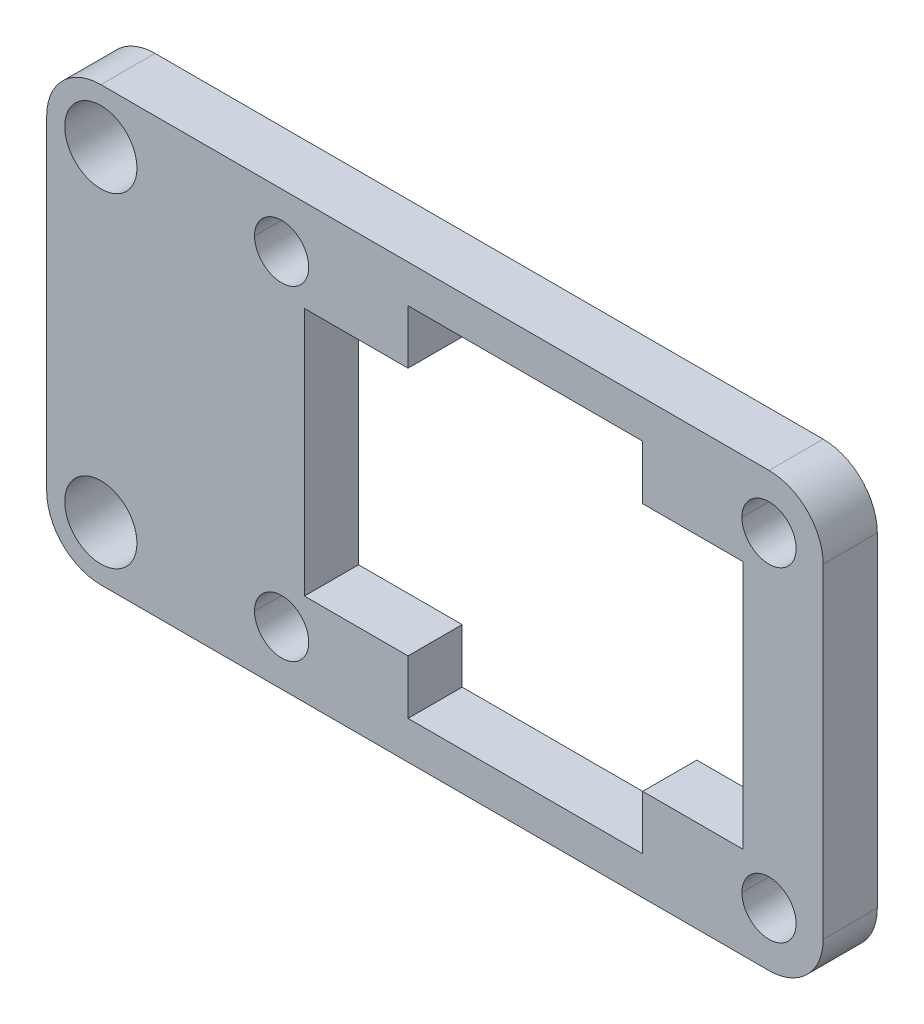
ISO-10303-21;
HEADER;
FILE_DESCRIPTION(('STEP AP214'),'2;1');
FILE_NAME('part.step','',(''),(''),'','','');
FILE_SCHEMA(('AUTOMOTIVE_DESIGN { 1 0 10303 214 1 1 1 1 }'));
ENDSEC;
DATA;
#1=APPLICATION_CONTEXT('core data for automotive mechanical design processes');
#2=APPLICATION_PROTOCOL_DEFINITION('international standard','automotive_design',2000,#1);
#3=PRODUCT_CONTEXT('',#1,'mechanical');
#4=PRODUCT('Part','Part','',(#3));
#5=PRODUCT_RELATED_PRODUCT_CATEGORY('part','',(#4));
#6=PRODUCT_DEFINITION_FORMATION('','',#4);
#7=PRODUCT_DEFINITION_CONTEXT('part definition',#1,'design');
#8=PRODUCT_DEFINITION('design','',#6,#7);
#9=PRODUCT_DEFINITION_SHAPE('','',#8);
#10=(LENGTH_UNIT() NAMED_UNIT(*) SI_UNIT(.MILLI.,.METRE.));
#11=(NAMED_UNIT(*) PLANE_ANGLE_UNIT() SI_UNIT($,.RADIAN.));
#12=(NAMED_UNIT(*) SI_UNIT($,.STERADIAN.) SOLID_ANGLE_UNIT());
#13=UNCERTAINTY_MEASURE_WITH_UNIT(LENGTH_MEASURE(1.E-05),#10,'distance_accuracy_value','');
#14=(GEOMETRIC_REPRESENTATION_CONTEXT(3) GLOBAL_UNCERTAINTY_ASSIGNED_CONTEXT((#13)) GLOBAL_UNIT_ASSIGNED_CONTEXT((#10,
#11,#12)) REPRESENTATION_CONTEXT('',''));
#15=CARTESIAN_POINT('',(0.,0.,0.));
#16=DIRECTION('',(0.,0.,1.));
#17=DIRECTION('',(1.,0.,0.));
#18=AXIS2_PLACEMENT_3D('',#15,#16,#17);
#19=CARTESIAN_POINT('',(63.748376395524,-38.3124718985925,0.));
#20=DIRECTION('',(0.,0.,-1.));
#21=DIRECTION('',(-1.,0.,0.));
#22=AXIS2_PLACEMENT_3D('',#19,#20,#21);
#23=PLANE('',#22);
#24=CARTESIAN_POINT('',(26.7321907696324,-56.3124718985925,0.));
#25=DIRECTION('',(0.,0.,1.));
#26=DIRECTION('',(1.,0.,0.));
#27=AXIS2_PLACEMENT_3D('',#24,#25,#26);
#28=CIRCLE('',#27,2.);
#29=CARTESIAN_POINT('',(28.7321907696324,-56.3124718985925,0.));
#30=VERTEX_POINT('',#29);
#31=EDGE_CURVE('E775',#30,#30,#28,.T.);
#32=ORIENTED_EDGE('',*,*,#31,.T.);
#33=EDGE_LOOP('',(#32));
#34=FACE_BOUND('',#33,.T.);
#35=CARTESIAN_POINT('',(26.7321907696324,-38.3124718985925,0.));
#36=DIRECTION('',(0.,0.,1.));
#37=DIRECTION('',(1.,0.,0.));
#38=AXIS2_PLACEMENT_3D('',#35,#36,#37);
#39=CIRCLE('',#38,2.);
#40=CARTESIAN_POINT('',(28.7321907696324,-38.3124718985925,0.));
#41=VERTEX_POINT('',#40);
#42=EDGE_CURVE('E261',#41,#41,#39,.T.);
#43=ORIENTED_EDGE('',*,*,#42,.T.);
#44=EDGE_LOOP('',(#43));
#45=FACE_BOUND('',#44,.T.);
#46=CARTESIAN_POINT('',(36.748376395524,-38.3124718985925,0.));
#47=DIRECTION('',(0.,0.,-1.));
#48=DIRECTION('',(-1.,0.,0.));
#49=AXIS2_PLACEMENT_3D('',#46,#47,#48);
#50=CIRCLE('',#49,1.5);
#51=CARTESIAN_POINT('',(35.248376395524,-38.3124718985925,0.));
#52=VERTEX_POINT('',#51);
#53=CARTESIAN_POINT('',(38.248376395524,-38.3124718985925,0.));
#54=VERTEX_POINT('',#53);
#55=EDGE_CURVE('E384',#52,#54,#50,.F.);
#56=ORIENTED_EDGE('',*,*,#55,.T.);
#57=CARTESIAN_POINT('',(36.748376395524,-38.3124718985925,0.));
#58=DIRECTION('',(0.,0.,-1.));
#59=DIRECTION('',(-1.,0.,0.));
#60=AXIS2_PLACEMENT_3D('',#57,#58,#59);
#61=CIRCLE('',#60,1.5);
#62=EDGE_CURVE('E33',#54,#52,#61,.F.);
#63=ORIENTED_EDGE('',*,*,#62,.T.);
#64=EDGE_LOOP('',(#56,#63));
#65=FACE_BOUND('',#64,.T.);
#66=CARTESIAN_POINT('',(63.748376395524,-56.3124718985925,0.));
#67=DIRECTION('',(0.,0.,-1.));
#68=DIRECTION('',(-1.,0.,0.));
#69=AXIS2_PLACEMENT_3D('',#66,#67,#68);
#70=CIRCLE('',#69,1.49999999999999);
#71=CARTESIAN_POINT('',(62.248376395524,-56.3124718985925,0.));
#72=VERTEX_POINT('',#71);
#73=CARTESIAN_POINT('',(65.248376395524,-56.3124718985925,0.));
#74=VERTEX_POINT('',#73);
#75=EDGE_CURVE('E376',#72,#74,#70,.F.);
#76=ORIENTED_EDGE('',*,*,#75,.T.);
#77=CARTESIAN_POINT('',(63.748376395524,-56.3124718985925,0.));
#78=DIRECTION('',(0.,0.,-1.));
#79=DIRECTION('',(-1.,0.,0.));
#80=AXIS2_PLACEMENT_3D('',#77,#78,#79);
#81=CIRCLE('',#80,1.49999999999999);
#82=EDGE_CURVE('E380',#74,#72,#81,.F.);
#83=ORIENTED_EDGE('',*,*,#82,.T.);
#84=EDGE_LOOP('',(#76,#83));
#85=FACE_BOUND('',#84,.T.);
#86=CARTESIAN_POINT('',(26.7321907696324,-38.3124718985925,0.));
#87=DIRECTION('',(0.,0.,-1.));
#88=DIRECTION('',(-1.,0.,0.));
#89=AXIS2_PLACEMENT_3D('',#86,#87,#88);
#90=CIRCLE('',#89,3.);
#91=CARTESIAN_POINT('',(26.7321907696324,-35.3124718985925,0.));
#92=VERTEX_POINT('',#91);
#93=CARTESIAN_POINT('',(23.7321907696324,-38.3124718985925,0.));
#94=VERTEX_POINT('',#93);
#95=EDGE_CURVE('E357',#92,#94,#90,.F.);
#96=ORIENTED_EDGE('',*,*,#95,.F.);
#97=DIRECTION('',(1.,0.,0.));
#98=VECTOR('',#97,1.);
#99=CARTESIAN_POINT('',(26.7321907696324,-35.3124718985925,0.));
#100=LINE('',#99,#98);
#101=CARTESIAN_POINT('',(63.748376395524,-35.3124718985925,0.));
#102=VERTEX_POINT('',#101);
#103=EDGE_CURVE('E354',#92,#102,#100,.T.);
#104=ORIENTED_EDGE('',*,*,#103,.T.);
#105=CARTESIAN_POINT('',(63.748376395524,-38.3124718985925,0.));
#106=DIRECTION('',(0.,0.,-1.));
#107=DIRECTION('',(-1.,0.,0.));
#108=AXIS2_PLACEMENT_3D('',#105,#106,#107);
#109=CIRCLE('',#108,3.);
#110=CARTESIAN_POINT('',(66.748376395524,-38.3124718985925,0.));
#111=VERTEX_POINT('',#110);
#112=EDGE_CURVE('E348',#111,#102,#109,.F.);
#113=ORIENTED_EDGE('',*,*,#112,.F.);
#114=DIRECTION('',(0.,-1.,0.));
#115=VECTOR('',#114,1.);
#116=CARTESIAN_POINT('',(66.748376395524,-38.3124718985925,0.));
#117=LINE('',#116,#115);
#118=CARTESIAN_POINT('',(66.748376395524,-56.3124718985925,0.));
#119=VERTEX_POINT('',#118);
#120=EDGE_CURVE('E375',#111,#119,#117,.T.);
#121=ORIENTED_EDGE('',*,*,#120,.T.);
#122=CARTESIAN_POINT('',(63.748376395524,-56.3124718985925,0.));
#123=DIRECTION('',(0.,0.,-1.));
#124=DIRECTION('',(-1.,0.,0.));
#125=AXIS2_PLACEMENT_3D('',#122,#123,#124);
#126=CIRCLE('',#125,3.);
#127=CARTESIAN_POINT('',(63.748376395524,-59.3124718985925,0.));
#128=VERTEX_POINT('',#127);
#129=EDGE_CURVE('E371',#128,#119,#126,.F.);
#130=ORIENTED_EDGE('',*,*,#129,.F.);
#131=DIRECTION('',(1.,0.,0.));
#132=VECTOR('',#131,1.);
#133=CARTESIAN_POINT('',(26.7321907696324,-59.3124718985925,0.));
#134=LINE('',#133,#132);
#135=CARTESIAN_POINT('',(26.7321907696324,-59.3124718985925,0.));
#136=VERTEX_POINT('',#135);
#137=EDGE_CURVE('E368',#128,#136,#134,.F.);
#138=ORIENTED_EDGE('',*,*,#137,.T.);
#139=CARTESIAN_POINT('',(26.7321907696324,-56.3124718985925,0.));
#140=DIRECTION('',(0.,0.,-1.));
#141=DIRECTION('',(-1.,0.,0.));
#142=AXIS2_PLACEMENT_3D('',#139,#140,#141);
#143=CIRCLE('',#142,3.);
#144=CARTESIAN_POINT('',(23.7321907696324,-56.3124718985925,0.));
#145=VERTEX_POINT('',#144);
#146=EDGE_CURVE('E364',#145,#136,#143,.F.);
#147=ORIENTED_EDGE('',*,*,#146,.F.);
#148=DIRECTION('',(0.,1.,0.));
#149=VECTOR('',#148,1.);
#150=CARTESIAN_POINT('',(23.7321907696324,-38.3124718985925,0.));
#151=LINE('',#150,#149);
#152=EDGE_CURVE('E361',#145,#94,#151,.T.);
#153=ORIENTED_EDGE('',*,*,#152,.T.);
#154=EDGE_LOOP('',(#96,#104,#113,#121,#130,#138,#147,#153));
#155=FACE_BOUND('',#154,.T.);
#156=CARTESIAN_POINT('',(63.748376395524,-38.3124718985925,0.));
#157=DIRECTION('',(0.,0.,-1.));
#158=DIRECTION('',(-1.,0.,0.));
#159=AXIS2_PLACEMENT_3D('',#156,#157,#158);
#160=CIRCLE('',#159,1.49999999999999);
#161=CARTESIAN_POINT('',(62.248376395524,-38.3124718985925,0.));
#162=VERTEX_POINT('',#161);
#163=CARTESIAN_POINT('',(65.248376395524,-38.3124718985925,0.));
#164=VERTEX_POINT('',#163);
#165=EDGE_CURVE('E340',#162,#164,#160,.F.);
#166=ORIENTED_EDGE('',*,*,#165,.T.);
#167=CARTESIAN_POINT('',(63.748376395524,-38.3124718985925,0.));
#168=DIRECTION('',(0.,0.,-1.));
#169=DIRECTION('',(-1.,0.,0.));
#170=AXIS2_PLACEMENT_3D('',#167,#168,#169);
#171=CIRCLE('',#170,1.49999999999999);
#172=EDGE_CURVE('E344',#164,#162,#171,.F.);
#173=ORIENTED_EDGE('',*,*,#172,.T.);
#174=EDGE_LOOP('',(#166,#173));
#175=FACE_BOUND('',#174,.T.);
#176=CARTESIAN_POINT('',(36.748376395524,-56.3124718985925,0.));
#177=DIRECTION('',(0.,0.,-1.));
#178=DIRECTION('',(-1.,0.,0.));
#179=AXIS2_PLACEMENT_3D('',#176,#177,#178);
#180=CIRCLE('',#179,1.5);
#181=CARTESIAN_POINT('',(35.248376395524,-56.3124718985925,0.));
#182=VERTEX_POINT('',#181);
#183=CARTESIAN_POINT('',(38.248376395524,-56.3124718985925,0.));
#184=VERTEX_POINT('',#183);
#185=EDGE_CURVE('E332',#182,#184,#180,.F.);
#186=ORIENTED_EDGE('',*,*,#185,.T.);
#187=CARTESIAN_POINT('',(36.748376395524,-56.3124718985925,0.));
#188=DIRECTION('',(0.,0.,-1.));
#189=DIRECTION('',(-1.,0.,0.));
#190=AXIS2_PLACEMENT_3D('',#187,#188,#189);
#191=CIRCLE('',#190,1.5);
#192=EDGE_CURVE('E336',#184,#182,#191,.F.);
#193=ORIENTED_EDGE('',*,*,#192,.T.);
#194=EDGE_LOOP('',(#186,#193));
#195=FACE_BOUND('',#194,.T.);
#196=DIRECTION('',(-1.,0.,0.));
#197=VECTOR('',#196,1.);
#198=CARTESIAN_POINT('',(38.01,-40.41,0.));
#199=LINE('',#198,#197);
#200=CARTESIAN_POINT('',(43.75,-40.41,0.));
#201=VERTEX_POINT('',#200);
#202=CARTESIAN_POINT('',(38.01,-40.41,0.));
#203=VERTEX_POINT('',#202);
#204=EDGE_CURVE('E225',#201,#203,#199,.T.);
#205=ORIENTED_EDGE('',*,*,#204,.T.);
#206=DIRECTION('',(0.,-1.,0.));
#207=VECTOR('',#206,1.);
#208=CARTESIAN_POINT('',(38.01,-40.41,0.));
#209=LINE('',#208,#207);
#210=CARTESIAN_POINT('',(38.01,-54.21,0.));
#211=VERTEX_POINT('',#210);
#212=EDGE_CURVE('E46',#203,#211,#209,.T.);
#213=ORIENTED_EDGE('',*,*,#212,.T.);
#214=DIRECTION('',(1.,0.,0.));
#215=VECTOR('',#214,1.);
#216=CARTESIAN_POINT('',(43.75,-54.21,0.));
#217=LINE('',#216,#215);
#218=CARTESIAN_POINT('',(43.75,-54.21,0.));
#219=VERTEX_POINT('',#218);
#220=EDGE_CURVE('E231',#211,#219,#217,.T.);
#221=ORIENTED_EDGE('',*,*,#220,.T.);
#222=DIRECTION('',(0.,-1.,0.));
#223=VECTOR('',#222,1.);
#224=CARTESIAN_POINT('',(43.75,-54.21,0.));
#225=LINE('',#224,#223);
#226=CARTESIAN_POINT('',(43.75,-57.21,0.));
#227=VERTEX_POINT('',#226);
#228=EDGE_CURVE('E263',#219,#227,#225,.T.);
#229=ORIENTED_EDGE('',*,*,#228,.T.);
#230=DIRECTION('',(1.,0.,0.));
#231=VECTOR('',#230,1.);
#232=CARTESIAN_POINT('',(56.7500000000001,-57.21,0.));
#233=LINE('',#232,#231);
#234=CARTESIAN_POINT('',(56.7500000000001,-57.21,0.));
#235=VERTEX_POINT('',#234);
#236=EDGE_CURVE('E266',#227,#235,#233,.T.);
#237=ORIENTED_EDGE('',*,*,#236,.T.);
#238=DIRECTION('',(0.,1.,0.));
#239=VECTOR('',#238,1.);
#240=CARTESIAN_POINT('',(56.7500000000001,-54.21,0.));
#241=LINE('',#240,#239);
#242=CARTESIAN_POINT('',(56.7500000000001,-54.21,0.));
#243=VERTEX_POINT('',#242);
#244=EDGE_CURVE('E269',#235,#243,#241,.T.);
#245=ORIENTED_EDGE('',*,*,#244,.T.);
#246=DIRECTION('',(1.,0.,0.));
#247=VECTOR('',#246,1.);
#248=CARTESIAN_POINT('',(62.31,-54.21,0.));
#249=LINE('',#248,#247);
#250=CARTESIAN_POINT('',(62.31,-54.21,0.));
#251=VERTEX_POINT('',#250);
#252=EDGE_CURVE('E272',#243,#251,#249,.T.);
#253=ORIENTED_EDGE('',*,*,#252,.T.);
#254=DIRECTION('',(0.,1.,0.));
#255=VECTOR('',#254,1.);
#256=CARTESIAN_POINT('',(62.31,-40.41,0.));
#257=LINE('',#256,#255);
#258=CARTESIAN_POINT('',(62.31,-40.41,0.));
#259=VERTEX_POINT('',#258);
#260=EDGE_CURVE('E275',#251,#259,#257,.T.);
#261=ORIENTED_EDGE('',*,*,#260,.T.);
#262=DIRECTION('',(-1.,0.,0.));
#263=VECTOR('',#262,1.);
#264=CARTESIAN_POINT('',(56.75,-40.41,0.));
#265=LINE('',#264,#263);
#266=CARTESIAN_POINT('',(56.75,-40.41,0.));
#267=VERTEX_POINT('',#266);
#268=EDGE_CURVE('E278',#259,#267,#265,.T.);
#269=ORIENTED_EDGE('',*,*,#268,.T.);
#270=DIRECTION('',(0.,1.,0.));
#271=VECTOR('',#270,1.);
#272=CARTESIAN_POINT('',(56.75,-40.41,0.));
#273=LINE('',#272,#271);
#274=CARTESIAN_POINT('',(56.75,-37.41,0.));
#275=VERTEX_POINT('',#274);
#276=EDGE_CURVE('E281',#267,#275,#273,.T.);
#277=ORIENTED_EDGE('',*,*,#276,.T.);
#278=DIRECTION('',(-1.,0.,0.));
#279=VECTOR('',#278,1.);
#280=CARTESIAN_POINT('',(43.75,-37.41,0.));
#281=LINE('',#280,#279);
#282=CARTESIAN_POINT('',(43.75,-37.41,0.));
#283=VERTEX_POINT('',#282);
#284=EDGE_CURVE('E284',#275,#283,#281,.T.);
#285=ORIENTED_EDGE('',*,*,#284,.T.);
#286=DIRECTION('',(0.,-1.,0.));
#287=VECTOR('',#286,1.);
#288=CARTESIAN_POINT('',(43.75,-40.41,0.));
#289=LINE('',#288,#287);
#290=EDGE_CURVE('E287',#283,#201,#289,.T.);
#291=ORIENTED_EDGE('',*,*,#290,.T.);
#292=EDGE_LOOP('',(#205,#213,#221,#229,#237,#245,#253,#261,#269,#277,#285,#291));
#293=FACE_BOUND('',#292,.T.);
#294=ADVANCED_FACE('F30',(#34,#45,#65,#85,#155,#175,#195,#293),#23,.T.);
#295=CARTESIAN_POINT('',(63.748376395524,-38.3124718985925,3.));
#296=DIRECTION('',(0.,0.,-1.));
#297=DIRECTION('',(-1.,0.,0.));
#298=AXIS2_PLACEMENT_3D('',#295,#296,#297);
#299=PLANE('',#298);
#300=CARTESIAN_POINT('',(26.7321907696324,-56.3124718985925,3.));
#301=DIRECTION('',(0.,0.,1.));
#302=DIRECTION('',(1.,0.,0.));
#303=AXIS2_PLACEMENT_3D('',#300,#301,#302);
#304=CIRCLE('',#303,2.);
#305=CARTESIAN_POINT('',(28.7321907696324,-56.3124718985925,3.));
#306=VERTEX_POINT('',#305);
#307=EDGE_CURVE('E778',#306,#306,#304,.T.);
#308=ORIENTED_EDGE('',*,*,#307,.F.);
#309=EDGE_LOOP('',(#308));
#310=FACE_BOUND('',#309,.T.);
#311=CARTESIAN_POINT('',(26.7321907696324,-38.3124718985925,3.));
#312=DIRECTION('',(0.,0.,1.));
#313=DIRECTION('',(1.,0.,0.));
#314=AXIS2_PLACEMENT_3D('',#311,#312,#313);
#315=CIRCLE('',#314,2.);
#316=CARTESIAN_POINT('',(28.7321907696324,-38.3124718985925,3.));
#317=VERTEX_POINT('',#316);
#318=EDGE_CURVE('E780',#317,#317,#315,.T.);
#319=ORIENTED_EDGE('',*,*,#318,.F.);
#320=EDGE_LOOP('',(#319));
#321=FACE_BOUND('',#320,.T.);
#322=CARTESIAN_POINT('',(36.748376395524,-38.3124718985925,3.));
#323=DIRECTION('',(0.,0.,-1.));
#324=DIRECTION('',(-1.,0.,0.));
#325=AXIS2_PLACEMENT_3D('',#322,#323,#324);
#326=CIRCLE('',#325,1.5);
#327=CARTESIAN_POINT('',(38.248376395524,-38.3124718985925,3.));
#328=VERTEX_POINT('',#327);
#329=CARTESIAN_POINT('',(35.248376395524,-38.3124718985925,3.));
#330=VERTEX_POINT('',#329);
#331=EDGE_CURVE('E331',#328,#330,#326,.F.);
#332=ORIENTED_EDGE('',*,*,#331,.F.);
#333=CARTESIAN_POINT('',(36.748376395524,-38.3124718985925,3.));
#334=DIRECTION('',(0.,0.,-1.));
#335=DIRECTION('',(-1.,0.,0.));
#336=AXIS2_PLACEMENT_3D('',#333,#334,#335);
#337=CIRCLE('',#336,1.5);
#338=EDGE_CURVE('E417',#330,#328,#337,.F.);
#339=ORIENTED_EDGE('',*,*,#338,.F.);
#340=EDGE_LOOP('',(#332,#339));
#341=FACE_BOUND('',#340,.T.);
#342=CARTESIAN_POINT('',(63.748376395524,-56.3124718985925,3.));
#343=DIRECTION('',(0.,0.,-1.));
#344=DIRECTION('',(-1.,0.,0.));
#345=AXIS2_PLACEMENT_3D('',#342,#343,#344);
#346=CIRCLE('',#345,1.49999999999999);
#347=CARTESIAN_POINT('',(65.248376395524,-56.3124718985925,3.));
#348=VERTEX_POINT('',#347);
#349=CARTESIAN_POINT('',(62.248376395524,-56.3124718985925,3.));
#350=VERTEX_POINT('',#349);
#351=EDGE_CURVE('E414',#348,#350,#346,.F.);
#352=ORIENTED_EDGE('',*,*,#351,.F.);
#353=CARTESIAN_POINT('',(63.748376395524,-56.3124718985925,3.));
#354=DIRECTION('',(0.,0.,-1.));
#355=DIRECTION('',(-1.,0.,0.));
#356=AXIS2_PLACEMENT_3D('',#353,#354,#355);
#357=CIRCLE('',#356,1.49999999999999);
#358=EDGE_CURVE('E327',#350,#348,#357,.F.);
#359=ORIENTED_EDGE('',*,*,#358,.F.);
#360=EDGE_LOOP('',(#352,#359));
#361=FACE_BOUND('',#360,.T.);
#362=DIRECTION('',(-1.,0.,0.));
#363=VECTOR('',#362,1.);
#364=CARTESIAN_POINT('',(63.748376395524,-35.3124718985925,3.));
#365=LINE('',#364,#363);
#366=CARTESIAN_POINT('',(26.7321907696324,-35.3124718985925,3.));
#367=VERTEX_POINT('',#366);
#368=CARTESIAN_POINT('',(63.748376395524,-35.3124718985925,3.));
#369=VERTEX_POINT('',#368);
#370=EDGE_CURVE('E311',#367,#369,#365,.F.);
#371=ORIENTED_EDGE('',*,*,#370,.F.);
#372=CARTESIAN_POINT('',(26.7321907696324,-38.3124718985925,3.));
#373=DIRECTION('',(0.,0.,-1.));
#374=DIRECTION('',(-1.,0.,0.));
#375=AXIS2_PLACEMENT_3D('',#372,#373,#374);
#376=CIRCLE('',#375,3.);
#377=CARTESIAN_POINT('',(23.7321907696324,-38.3124718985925,3.));
#378=VERTEX_POINT('',#377);
#379=EDGE_CURVE('E315',#378,#367,#376,.T.);
#380=ORIENTED_EDGE('',*,*,#379,.F.);
#381=DIRECTION('',(0.,1.,0.));
#382=VECTOR('',#381,1.);
#383=CARTESIAN_POINT('',(23.7321907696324,-38.3124718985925,3.));
#384=LINE('',#383,#382);
#385=CARTESIAN_POINT('',(23.7321907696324,-56.3124718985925,3.));
#386=VERTEX_POINT('',#385);
#387=EDGE_CURVE('E316',#386,#378,#384,.T.);
#388=ORIENTED_EDGE('',*,*,#387,.F.);
#389=CARTESIAN_POINT('',(26.7321907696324,-56.3124718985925,3.));
#390=DIRECTION('',(0.,0.,-1.));
#391=DIRECTION('',(-1.,0.,0.));
#392=AXIS2_PLACEMENT_3D('',#389,#390,#391);
#393=CIRCLE('',#392,3.);
#394=CARTESIAN_POINT('',(26.7321907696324,-59.3124718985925,3.));
#395=VERTEX_POINT('',#394);
#396=EDGE_CURVE('E319',#395,#386,#393,.T.);
#397=ORIENTED_EDGE('',*,*,#396,.F.);
#398=DIRECTION('',(-1.,0.,0.));
#399=VECTOR('',#398,1.);
#400=CARTESIAN_POINT('',(63.748376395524,-59.3124718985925,3.));
#401=LINE('',#400,#399);
#402=CARTESIAN_POINT('',(63.748376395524,-59.3124718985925,3.));
#403=VERTEX_POINT('',#402);
#404=EDGE_CURVE('E320',#403,#395,#401,.T.);
#405=ORIENTED_EDGE('',*,*,#404,.F.);
#406=CARTESIAN_POINT('',(63.748376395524,-56.3124718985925,3.));
#407=DIRECTION('',(0.,0.,-1.));
#408=DIRECTION('',(-1.,0.,0.));
#409=AXIS2_PLACEMENT_3D('',#406,#407,#408);
#410=CIRCLE('',#409,3.);
#411=CARTESIAN_POINT('',(66.748376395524,-56.3124718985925,3.));
#412=VERTEX_POINT('',#411);
#413=EDGE_CURVE('E323',#412,#403,#410,.T.);
#414=ORIENTED_EDGE('',*,*,#413,.F.);
#415=DIRECTION('',(0.,1.,0.));
#416=VECTOR('',#415,1.);
#417=CARTESIAN_POINT('',(66.748376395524,-38.3124718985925,3.));
#418=LINE('',#417,#416);
#419=CARTESIAN_POINT('',(66.748376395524,-38.3124718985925,3.));
#420=VERTEX_POINT('',#419);
#421=EDGE_CURVE('E324',#420,#412,#418,.F.);
#422=ORIENTED_EDGE('',*,*,#421,.F.);
#423=CARTESIAN_POINT('',(63.748376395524,-38.3124718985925,3.));
#424=DIRECTION('',(0.,0.,-1.));
#425=DIRECTION('',(-1.,0.,0.));
#426=AXIS2_PLACEMENT_3D('',#423,#424,#425);
#427=CIRCLE('',#426,3.);
#428=EDGE_CURVE('E314',#369,#420,#427,.T.);
#429=ORIENTED_EDGE('',*,*,#428,.F.);
#430=EDGE_LOOP('',(#371,#380,#388,#397,#405,#414,#422,#429));
#431=FACE_BOUND('',#430,.T.);
#432=CARTESIAN_POINT('',(63.748376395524,-38.3124718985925,3.));
#433=DIRECTION('',(0.,0.,-1.));
#434=DIRECTION('',(-1.,0.,0.));
#435=AXIS2_PLACEMENT_3D('',#432,#433,#434);
#436=CIRCLE('',#435,1.49999999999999);
#437=CARTESIAN_POINT('',(65.248376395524,-38.3124718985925,3.));
#438=VERTEX_POINT('',#437);
#439=CARTESIAN_POINT('',(62.248376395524,-38.3124718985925,3.));
#440=VERTEX_POINT('',#439);
#441=EDGE_CURVE('E401',#438,#440,#436,.F.);
#442=ORIENTED_EDGE('',*,*,#441,.F.);
#443=CARTESIAN_POINT('',(63.748376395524,-38.3124718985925,3.));
#444=DIRECTION('',(0.,0.,-1.));
#445=DIRECTION('',(-1.,0.,0.));
#446=AXIS2_PLACEMENT_3D('',#443,#444,#445);
#447=CIRCLE('',#446,1.49999999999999);
#448=EDGE_CURVE('E398',#440,#438,#447,.F.);
#449=ORIENTED_EDGE('',*,*,#448,.F.);
#450=EDGE_LOOP('',(#442,#449));
#451=FACE_BOUND('',#450,.T.);
#452=CARTESIAN_POINT('',(36.748376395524,-56.3124718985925,3.));
#453=DIRECTION('',(0.,0.,-1.));
#454=DIRECTION('',(-1.,0.,0.));
#455=AXIS2_PLACEMENT_3D('',#452,#453,#454);
#456=CIRCLE('',#455,1.5);
#457=CARTESIAN_POINT('',(38.248376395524,-56.3124718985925,3.));
#458=VERTEX_POINT('',#457);
#459=CARTESIAN_POINT('',(35.248376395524,-56.3124718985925,3.));
#460=VERTEX_POINT('',#459);
#461=EDGE_CURVE('E38',#458,#460,#456,.F.);
#462=ORIENTED_EDGE('',*,*,#461,.F.);
#463=CARTESIAN_POINT('',(36.748376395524,-56.3124718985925,3.));
#464=DIRECTION('',(0.,0.,-1.));
#465=DIRECTION('',(-1.,0.,0.));
#466=AXIS2_PLACEMENT_3D('',#463,#464,#465);
#467=CIRCLE('',#466,1.5);
#468=EDGE_CURVE('E11',#460,#458,#467,.F.);
#469=ORIENTED_EDGE('',*,*,#468,.F.);
#470=EDGE_LOOP('',(#462,#469));
#471=FACE_BOUND('',#470,.T.);
#472=DIRECTION('',(0.,-1.,0.));
#473=VECTOR('',#472,1.);
#474=CARTESIAN_POINT('',(38.01,-40.41,3.));
#475=LINE('',#474,#473);
#476=CARTESIAN_POINT('',(38.01,-40.41,3.));
#477=VERTEX_POINT('',#476);
#478=CARTESIAN_POINT('',(38.01,-54.21,3.));
#479=VERTEX_POINT('',#478);
#480=EDGE_CURVE('E216',#477,#479,#475,.T.);
#481=ORIENTED_EDGE('',*,*,#480,.F.);
#482=DIRECTION('',(-1.,0.,0.));
#483=VECTOR('',#482,1.);
#484=CARTESIAN_POINT('',(38.01,-40.41,3.));
#485=LINE('',#484,#483);
#486=CARTESIAN_POINT('',(43.75,-40.41,3.));
#487=VERTEX_POINT('',#486);
#488=EDGE_CURVE('E258',#487,#477,#485,.T.);
#489=ORIENTED_EDGE('',*,*,#488,.F.);
#490=DIRECTION('',(0.,-1.,0.));
#491=VECTOR('',#490,1.);
#492=CARTESIAN_POINT('',(43.75,-40.41,3.));
#493=LINE('',#492,#491);
#494=CARTESIAN_POINT('',(43.75,-37.41,3.));
#495=VERTEX_POINT('',#494);
#496=EDGE_CURVE('E256',#495,#487,#493,.T.);
#497=ORIENTED_EDGE('',*,*,#496,.F.);
#498=DIRECTION('',(-1.,0.,0.));
#499=VECTOR('',#498,1.);
#500=CARTESIAN_POINT('',(43.75,-37.41,3.));
#501=LINE('',#500,#499);
#502=CARTESIAN_POINT('',(56.75,-37.41,3.));
#503=VERTEX_POINT('',#502);
#504=EDGE_CURVE('E254',#503,#495,#501,.T.);
#505=ORIENTED_EDGE('',*,*,#504,.F.);
#506=DIRECTION('',(0.,1.,0.));
#507=VECTOR('',#506,1.);
#508=CARTESIAN_POINT('',(56.75,-40.41,3.));
#509=LINE('',#508,#507);
#510=CARTESIAN_POINT('',(56.75,-40.41,3.));
#511=VERTEX_POINT('',#510);
#512=EDGE_CURVE('E252',#511,#503,#509,.T.);
#513=ORIENTED_EDGE('',*,*,#512,.F.);
#514=DIRECTION('',(-1.,0.,0.));
#515=VECTOR('',#514,1.);
#516=CARTESIAN_POINT('',(56.75,-40.41,3.));
#517=LINE('',#516,#515);
#518=CARTESIAN_POINT('',(62.31,-40.41,3.));
#519=VERTEX_POINT('',#518);
#520=EDGE_CURVE('E250',#519,#511,#517,.T.);
#521=ORIENTED_EDGE('',*,*,#520,.F.);
#522=DIRECTION('',(0.,1.,0.));
#523=VECTOR('',#522,1.);
#524=CARTESIAN_POINT('',(62.31,-40.41,3.));
#525=LINE('',#524,#523);
#526=CARTESIAN_POINT('',(62.31,-54.21,3.));
#527=VERTEX_POINT('',#526);
#528=EDGE_CURVE('E248',#527,#519,#525,.T.);
#529=ORIENTED_EDGE('',*,*,#528,.F.);
#530=DIRECTION('',(1.,0.,0.));
#531=VECTOR('',#530,1.);
#532=CARTESIAN_POINT('',(62.31,-54.21,3.));
#533=LINE('',#532,#531);
#534=CARTESIAN_POINT('',(56.7500000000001,-54.21,3.));
#535=VERTEX_POINT('',#534);
#536=EDGE_CURVE('E246',#535,#527,#533,.T.);
#537=ORIENTED_EDGE('',*,*,#536,.F.);
#538=DIRECTION('',(0.,1.,0.));
#539=VECTOR('',#538,1.);
#540=CARTESIAN_POINT('',(56.7500000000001,-54.21,3.));
#541=LINE('',#540,#539);
#542=CARTESIAN_POINT('',(56.7500000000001,-57.21,3.));
#543=VERTEX_POINT('',#542);
#544=EDGE_CURVE('E244',#543,#535,#541,.T.);
#545=ORIENTED_EDGE('',*,*,#544,.F.);
#546=DIRECTION('',(1.,0.,0.));
#547=VECTOR('',#546,1.);
#548=CARTESIAN_POINT('',(56.7500000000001,-57.21,3.));
#549=LINE('',#548,#547);
#550=CARTESIAN_POINT('',(43.75,-57.21,3.));
#551=VERTEX_POINT('',#550);
#552=EDGE_CURVE('E239',#551,#543,#549,.T.);
#553=ORIENTED_EDGE('',*,*,#552,.F.);
#554=DIRECTION('',(0.,-1.,0.));
#555=VECTOR('',#554,1.);
#556=CARTESIAN_POINT('',(43.75,-54.21,3.));
#557=LINE('',#556,#555);
#558=CARTESIAN_POINT('',(43.75,-54.21,3.));
#559=VERTEX_POINT('',#558);
#560=EDGE_CURVE('E237',#559,#551,#557,.T.);
#561=ORIENTED_EDGE('',*,*,#560,.F.);
#562=DIRECTION('',(1.,0.,0.));
#563=VECTOR('',#562,1.);
#564=CARTESIAN_POINT('',(43.75,-54.21,3.));
#565=LINE('',#564,#563);
#566=EDGE_CURVE('E224',#479,#559,#565,.T.);
#567=ORIENTED_EDGE('',*,*,#566,.F.);
#568=EDGE_LOOP('',(#481,#489,#497,#505,#513,#521,#529,#537,#545,#553,#561,#567));
#569=FACE_BOUND('',#568,.T.);
#570=ADVANCED_FACE('F235',(#310,#321,#341,#361,#431,#451,#471,#569),#299,.F.);
#571=CARTESIAN_POINT('',(36.748376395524,-38.3124718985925,3.));
#572=DIRECTION('',(0.,0.,-1.));
#573=DIRECTION('',(-1.,0.,0.));
#574=AXIS2_PLACEMENT_3D('',#571,#572,#573);
#575=CYLINDRICAL_SURFACE('',#574,1.5);
#576=ORIENTED_EDGE('',*,*,#331,.T.);
#577=DIRECTION('',(0.,0.,-1.));
#578=VECTOR('',#577,1.);
#579=CARTESIAN_POINT('',(35.248376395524,-38.3124718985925,3.));
#580=LINE('',#579,#578);
#581=EDGE_CURVE('E385',#330,#52,#580,.T.);
#582=ORIENTED_EDGE('',*,*,#581,.T.);
#583=ORIENTED_EDGE('',*,*,#62,.F.);
#584=DIRECTION('',(0.,0.,-1.));
#585=VECTOR('',#584,1.);
#586=CARTESIAN_POINT('',(38.248376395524,-38.3124718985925,3.));
#587=LINE('',#586,#585);
#588=EDGE_CURVE('E381',#54,#328,#587,.F.);
#589=ORIENTED_EDGE('',*,*,#588,.T.);
#590=EDGE_LOOP('',(#576,#582,#583,#589));
#591=FACE_BOUND('',#590,.T.);
#592=ADVANCED_FACE('F443',(#591),#575,.F.);
#593=CARTESIAN_POINT('',(36.748376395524,-38.3124718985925,3.));
#594=DIRECTION('',(0.,0.,-1.));
#595=DIRECTION('',(-1.,0.,0.));
#596=AXIS2_PLACEMENT_3D('',#593,#594,#595);
#597=CYLINDRICAL_SURFACE('',#596,1.5);
#598=ORIENTED_EDGE('',*,*,#588,.F.);
#599=ORIENTED_EDGE('',*,*,#55,.F.);
#600=ORIENTED_EDGE('',*,*,#581,.F.);
#601=ORIENTED_EDGE('',*,*,#338,.T.);
#602=EDGE_LOOP('',(#598,#599,#600,#601));
#603=FACE_BOUND('',#602,.T.);
#604=ADVANCED_FACE('F440',(#603),#597,.F.);
#605=CARTESIAN_POINT('',(63.748376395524,-56.3124718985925,3.));
#606=DIRECTION('',(0.,0.,-1.));
#607=DIRECTION('',(-1.,0.,0.));
#608=AXIS2_PLACEMENT_3D('',#605,#606,#607);
#609=CYLINDRICAL_SURFACE('',#608,1.49999999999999);
#610=ORIENTED_EDGE('',*,*,#351,.T.);
#611=DIRECTION('',(0.,0.,-1.));
#612=VECTOR('',#611,1.);
#613=CARTESIAN_POINT('',(62.248376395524,-56.3124718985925,3.));
#614=LINE('',#613,#612);
#615=EDGE_CURVE('E377',#350,#72,#614,.T.);
#616=ORIENTED_EDGE('',*,*,#615,.T.);
#617=ORIENTED_EDGE('',*,*,#82,.F.);
#618=DIRECTION('',(0.,0.,-1.));
#619=VECTOR('',#618,1.);
#620=CARTESIAN_POINT('',(65.248376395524,-56.3124718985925,3.));
#621=LINE('',#620,#619);
#622=EDGE_CURVE('E372',#74,#348,#621,.F.);
#623=ORIENTED_EDGE('',*,*,#622,.T.);
#624=EDGE_LOOP('',(#610,#616,#617,#623));
#625=FACE_BOUND('',#624,.T.);
#626=ADVANCED_FACE('F570',(#625),#609,.F.);
#627=CARTESIAN_POINT('',(63.748376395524,-56.3124718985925,3.));
#628=DIRECTION('',(0.,0.,-1.));
#629=DIRECTION('',(-1.,0.,0.));
#630=AXIS2_PLACEMENT_3D('',#627,#628,#629);
#631=CYLINDRICAL_SURFACE('',#630,1.49999999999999);
#632=ORIENTED_EDGE('',*,*,#622,.F.);
#633=ORIENTED_EDGE('',*,*,#75,.F.);
#634=ORIENTED_EDGE('',*,*,#615,.F.);
#635=ORIENTED_EDGE('',*,*,#358,.T.);
#636=EDGE_LOOP('',(#632,#633,#634,#635));
#637=FACE_BOUND('',#636,.T.);
#638=ADVANCED_FACE('F566',(#637),#631,.F.);
#639=CARTESIAN_POINT('',(66.748376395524,-38.3124718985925,3.));
#640=DIRECTION('',(-1.,0.,0.));
#641=DIRECTION('',(0.,-1.,0.));
#642=AXIS2_PLACEMENT_3D('',#639,#640,#641);
#643=PLANE('',#642);
#644=DIRECTION('',(0.,0.,-1.));
#645=VECTOR('',#644,1.);
#646=CARTESIAN_POINT('',(66.748376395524,-38.3124718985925,3.));
#647=LINE('',#646,#645);
#648=EDGE_CURVE('E347',#420,#111,#647,.T.);
#649=ORIENTED_EDGE('',*,*,#648,.F.);
#650=ORIENTED_EDGE('',*,*,#421,.T.);
#651=DIRECTION('',(0.,0.,-1.));
#652=VECTOR('',#651,1.);
#653=CARTESIAN_POINT('',(66.748376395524,-56.3124718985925,3.));
#654=LINE('',#653,#652);
#655=EDGE_CURVE('E369',#119,#412,#654,.F.);
#656=ORIENTED_EDGE('',*,*,#655,.F.);
#657=ORIENTED_EDGE('',*,*,#120,.F.);
#658=EDGE_LOOP('',(#649,#650,#656,#657));
#659=FACE_BOUND('',#658,.T.);
#660=ADVANCED_FACE('F562',(#659),#643,.F.);
#661=CARTESIAN_POINT('',(63.748376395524,-56.3124718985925,3.));
#662=DIRECTION('',(0.,0.,-1.));
#663=DIRECTION('',(-1.,0.,0.));
#664=AXIS2_PLACEMENT_3D('',#661,#662,#663);
#665=CYLINDRICAL_SURFACE('',#664,3.);
#666=ORIENTED_EDGE('',*,*,#413,.T.);
#667=DIRECTION('',(0.,0.,1.));
#668=VECTOR('',#667,1.);
#669=CARTESIAN_POINT('',(63.748376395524,-59.3124718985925,3.));
#670=LINE('',#669,#668);
#671=EDGE_CURVE('E365',#403,#128,#670,.F.);
#672=ORIENTED_EDGE('',*,*,#671,.T.);
#673=ORIENTED_EDGE('',*,*,#129,.T.);
#674=ORIENTED_EDGE('',*,*,#655,.T.);
#675=EDGE_LOOP('',(#666,#672,#673,#674));
#676=FACE_BOUND('',#675,.T.);
#677=ADVANCED_FACE('F558',(#676),#665,.T.);
#678=CARTESIAN_POINT('',(26.7321907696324,-59.3124718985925,3.));
#679=DIRECTION('',(0.,1.,0.));
#680=DIRECTION('',(0.,0.,1.));
#681=AXIS2_PLACEMENT_3D('',#678,#679,#680);
#682=PLANE('',#681);
#683=ORIENTED_EDGE('',*,*,#671,.F.);
#684=ORIENTED_EDGE('',*,*,#404,.T.);
#685=DIRECTION('',(0.,0.,-1.));
#686=VECTOR('',#685,1.);
#687=CARTESIAN_POINT('',(26.7321907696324,-59.3124718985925,3.));
#688=LINE('',#687,#686);
#689=EDGE_CURVE('E362',#136,#395,#688,.F.);
#690=ORIENTED_EDGE('',*,*,#689,.F.);
#691=ORIENTED_EDGE('',*,*,#137,.F.);
#692=EDGE_LOOP('',(#683,#684,#690,#691));
#693=FACE_BOUND('',#692,.T.);
#694=ADVANCED_FACE('F554',(#693),#682,.F.);
#695=CARTESIAN_POINT('',(26.7321907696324,-56.3124718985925,3.));
#696=DIRECTION('',(0.,0.,-1.));
#697=DIRECTION('',(-1.,0.,0.));
#698=AXIS2_PLACEMENT_3D('',#695,#696,#697);
#699=CYLINDRICAL_SURFACE('',#698,3.);
#700=ORIENTED_EDGE('',*,*,#396,.T.);
#701=DIRECTION('',(0.,0.,1.));
#702=VECTOR('',#701,1.);
#703=CARTESIAN_POINT('',(23.7321907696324,-56.3124718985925,3.));
#704=LINE('',#703,#702);
#705=EDGE_CURVE('E358',#386,#145,#704,.F.);
#706=ORIENTED_EDGE('',*,*,#705,.T.);
#707=ORIENTED_EDGE('',*,*,#146,.T.);
#708=ORIENTED_EDGE('',*,*,#689,.T.);
#709=EDGE_LOOP('',(#700,#706,#707,#708));
#710=FACE_BOUND('',#709,.T.);
#711=ADVANCED_FACE('F550',(#710),#699,.T.);
#712=CARTESIAN_POINT('',(23.7321907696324,-38.3124718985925,3.));
#713=DIRECTION('',(1.,0.,0.));
#714=DIRECTION('',(0.,1.,0.));
#715=AXIS2_PLACEMENT_3D('',#712,#713,#714);
#716=PLANE('',#715);
#717=ORIENTED_EDGE('',*,*,#705,.F.);
#718=ORIENTED_EDGE('',*,*,#387,.T.);
#719=DIRECTION('',(0.,0.,-1.));
#720=VECTOR('',#719,1.);
#721=CARTESIAN_POINT('',(23.7321907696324,-38.3124718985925,3.));
#722=LINE('',#721,#720);
#723=EDGE_CURVE('E355',#94,#378,#722,.F.);
#724=ORIENTED_EDGE('',*,*,#723,.F.);
#725=ORIENTED_EDGE('',*,*,#152,.F.);
#726=EDGE_LOOP('',(#717,#718,#724,#725));
#727=FACE_BOUND('',#726,.T.);
#728=ADVANCED_FACE('F546',(#727),#716,.F.);
#729=CARTESIAN_POINT('',(26.7321907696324,-38.3124718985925,3.));
#730=DIRECTION('',(0.,0.,-1.));
#731=DIRECTION('',(-1.,0.,0.));
#732=AXIS2_PLACEMENT_3D('',#729,#730,#731);
#733=CYLINDRICAL_SURFACE('',#732,3.);
#734=ORIENTED_EDGE('',*,*,#379,.T.);
#735=DIRECTION('',(0.,0.,-1.));
#736=VECTOR('',#735,1.);
#737=CARTESIAN_POINT('',(26.7321907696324,-35.3124718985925,3.));
#738=LINE('',#737,#736);
#739=EDGE_CURVE('E351',#367,#92,#738,.T.);
#740=ORIENTED_EDGE('',*,*,#739,.T.);
#741=ORIENTED_EDGE('',*,*,#95,.T.);
#742=ORIENTED_EDGE('',*,*,#723,.T.);
#743=EDGE_LOOP('',(#734,#740,#741,#742));
#744=FACE_BOUND('',#743,.T.);
#745=ADVANCED_FACE('F542',(#744),#733,.T.);
#746=CARTESIAN_POINT('',(26.7321907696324,-35.3124718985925,3.));
#747=DIRECTION('',(0.,-1.,0.));
#748=DIRECTION('',(0.,0.,-1.));
#749=AXIS2_PLACEMENT_3D('',#746,#747,#748);
#750=PLANE('',#749);
#751=ORIENTED_EDGE('',*,*,#739,.F.);
#752=ORIENTED_EDGE('',*,*,#370,.T.);
#753=DIRECTION('',(0.,0.,-1.));
#754=VECTOR('',#753,1.);
#755=CARTESIAN_POINT('',(63.748376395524,-35.3124718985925,3.));
#756=LINE('',#755,#754);
#757=EDGE_CURVE('E345',#102,#369,#756,.F.);
#758=ORIENTED_EDGE('',*,*,#757,.F.);
#759=ORIENTED_EDGE('',*,*,#103,.F.);
#760=EDGE_LOOP('',(#751,#752,#758,#759));
#761=FACE_BOUND('',#760,.T.);
#762=ADVANCED_FACE('F538',(#761),#750,.F.);
#763=CARTESIAN_POINT('',(63.748376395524,-38.3124718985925,3.));
#764=DIRECTION('',(0.,0.,-1.));
#765=DIRECTION('',(-1.,0.,0.));
#766=AXIS2_PLACEMENT_3D('',#763,#764,#765);
#767=CYLINDRICAL_SURFACE('',#766,3.);
#768=ORIENTED_EDGE('',*,*,#428,.T.);
#769=ORIENTED_EDGE('',*,*,#648,.T.);
#770=ORIENTED_EDGE('',*,*,#112,.T.);
#771=ORIENTED_EDGE('',*,*,#757,.T.);
#772=EDGE_LOOP('',(#768,#769,#770,#771));
#773=FACE_BOUND('',#772,.T.);
#774=ADVANCED_FACE('F534',(#773),#767,.T.);
#775=CARTESIAN_POINT('',(63.748376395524,-38.3124718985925,3.));
#776=DIRECTION('',(0.,0.,-1.));
#777=DIRECTION('',(-1.,0.,0.));
#778=AXIS2_PLACEMENT_3D('',#775,#776,#777);
#779=CYLINDRICAL_SURFACE('',#778,1.49999999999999);
#780=ORIENTED_EDGE('',*,*,#441,.T.);
#781=DIRECTION('',(0.,0.,-1.));
#782=VECTOR('',#781,1.);
#783=CARTESIAN_POINT('',(62.248376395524,-38.3124718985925,3.));
#784=LINE('',#783,#782);
#785=EDGE_CURVE('E341',#440,#162,#784,.T.);
#786=ORIENTED_EDGE('',*,*,#785,.T.);
#787=ORIENTED_EDGE('',*,*,#172,.F.);
#788=DIRECTION('',(0.,0.,-1.));
#789=VECTOR('',#788,1.);
#790=CARTESIAN_POINT('',(65.248376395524,-38.3124718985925,3.));
#791=LINE('',#790,#789);
#792=EDGE_CURVE('E337',#164,#438,#791,.F.);
#793=ORIENTED_EDGE('',*,*,#792,.T.);
#794=EDGE_LOOP('',(#780,#786,#787,#793));
#795=FACE_BOUND('',#794,.T.);
#796=ADVANCED_FACE('F530',(#795),#779,.F.);
#797=CARTESIAN_POINT('',(63.748376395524,-38.3124718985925,3.));
#798=DIRECTION('',(0.,0.,-1.));
#799=DIRECTION('',(-1.,0.,0.));
#800=AXIS2_PLACEMENT_3D('',#797,#798,#799);
#801=CYLINDRICAL_SURFACE('',#800,1.49999999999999);
#802=ORIENTED_EDGE('',*,*,#792,.F.);
#803=ORIENTED_EDGE('',*,*,#165,.F.);
#804=ORIENTED_EDGE('',*,*,#785,.F.);
#805=ORIENTED_EDGE('',*,*,#448,.T.);
#806=EDGE_LOOP('',(#802,#803,#804,#805));
#807=FACE_BOUND('',#806,.T.);
#808=ADVANCED_FACE('F527',(#807),#801,.F.);
#809=CARTESIAN_POINT('',(36.748376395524,-56.3124718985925,3.));
#810=DIRECTION('',(0.,0.,-1.));
#811=DIRECTION('',(-1.,0.,0.));
#812=AXIS2_PLACEMENT_3D('',#809,#810,#811);
#813=CYLINDRICAL_SURFACE('',#812,1.5);
#814=ORIENTED_EDGE('',*,*,#461,.T.);
#815=DIRECTION('',(0.,0.,-1.));
#816=VECTOR('',#815,1.);
#817=CARTESIAN_POINT('',(35.248376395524,-56.3124718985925,3.));
#818=LINE('',#817,#816);
#819=EDGE_CURVE('E333',#460,#182,#818,.T.);
#820=ORIENTED_EDGE('',*,*,#819,.T.);
#821=ORIENTED_EDGE('',*,*,#192,.F.);
#822=DIRECTION('',(0.,0.,-1.));
#823=VECTOR('',#822,1.);
#824=CARTESIAN_POINT('',(38.248376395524,-56.3124718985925,3.));
#825=LINE('',#824,#823);
#826=EDGE_CURVE('E328',#184,#458,#825,.F.);
#827=ORIENTED_EDGE('',*,*,#826,.T.);
#828=EDGE_LOOP('',(#814,#820,#821,#827));
#829=FACE_BOUND('',#828,.T.);
#830=ADVANCED_FACE('F461',(#829),#813,.F.);
#831=CARTESIAN_POINT('',(36.748376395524,-56.3124718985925,3.));
#832=DIRECTION('',(0.,0.,-1.));
#833=DIRECTION('',(-1.,0.,0.));
#834=AXIS2_PLACEMENT_3D('',#831,#832,#833);
#835=CYLINDRICAL_SURFACE('',#834,1.5);
#836=ORIENTED_EDGE('',*,*,#826,.F.);
#837=ORIENTED_EDGE('',*,*,#185,.F.);
#838=ORIENTED_EDGE('',*,*,#819,.F.);
#839=ORIENTED_EDGE('',*,*,#468,.T.);
#840=EDGE_LOOP('',(#836,#837,#838,#839));
#841=FACE_BOUND('',#840,.T.);
#842=ADVANCED_FACE('F449',(#841),#835,.F.);
#843=CARTESIAN_POINT('',(38.01,-40.41,3.));
#844=DIRECTION('',(1.,0.,0.));
#845=DIRECTION('',(0.,0.,-1.));
#846=AXIS2_PLACEMENT_3D('',#843,#844,#845);
#847=PLANE('',#846);
#848=ORIENTED_EDGE('',*,*,#212,.F.);
#849=DIRECTION('',(0.,0.,-1.));
#850=VECTOR('',#849,1.);
#851=CARTESIAN_POINT('',(38.01,-40.41,3.));
#852=LINE('',#851,#850);
#853=EDGE_CURVE('E220',#477,#203,#852,.T.);
#854=ORIENTED_EDGE('',*,*,#853,.F.);
#855=ORIENTED_EDGE('',*,*,#480,.T.);
#856=DIRECTION('',(0.,0.,-1.));
#857=VECTOR('',#856,1.);
#858=CARTESIAN_POINT('',(38.01,-54.21,3.));
#859=LINE('',#858,#857);
#860=EDGE_CURVE('E219',#479,#211,#859,.T.);
#861=ORIENTED_EDGE('',*,*,#860,.T.);
#862=EDGE_LOOP('',(#848,#854,#855,#861));
#863=FACE_BOUND('',#862,.T.);
#864=ADVANCED_FACE('F218',(#863),#847,.T.);
#865=CARTESIAN_POINT('',(43.75,-54.21,3.));
#866=DIRECTION('',(0.,1.,0.));
#867=DIRECTION('',(0.,0.,1.));
#868=AXIS2_PLACEMENT_3D('',#865,#866,#867);
#869=PLANE('',#868);
#870=ORIENTED_EDGE('',*,*,#220,.F.);
#871=ORIENTED_EDGE('',*,*,#860,.F.);
#872=ORIENTED_EDGE('',*,*,#566,.T.);
#873=DIRECTION('',(0.,0.,-1.));
#874=VECTOR('',#873,1.);
#875=CARTESIAN_POINT('',(43.75,-54.21,3.));
#876=LINE('',#875,#874);
#877=EDGE_CURVE('E232',#559,#219,#876,.T.);
#878=ORIENTED_EDGE('',*,*,#877,.T.);
#879=EDGE_LOOP('',(#870,#871,#872,#878));
#880=FACE_BOUND('',#879,.T.);
#881=ADVANCED_FACE('F228',(#880),#869,.T.);
#882=CARTESIAN_POINT('',(43.75,-54.21,3.));
#883=DIRECTION('',(1.,0.,0.));
#884=DIRECTION('',(0.,0.,-1.));
#885=AXIS2_PLACEMENT_3D('',#882,#883,#884);
#886=PLANE('',#885);
#887=ORIENTED_EDGE('',*,*,#228,.F.);
#888=ORIENTED_EDGE('',*,*,#877,.F.);
#889=ORIENTED_EDGE('',*,*,#560,.T.);
#890=DIRECTION('',(0.,0.,-1.));
#891=VECTOR('',#890,1.);
#892=CARTESIAN_POINT('',(43.75,-57.21,3.));
#893=LINE('',#892,#891);
#894=EDGE_CURVE('E308',#551,#227,#893,.T.);
#895=ORIENTED_EDGE('',*,*,#894,.T.);
#896=EDGE_LOOP('',(#887,#888,#889,#895));
#897=FACE_BOUND('',#896,.T.);
#898=ADVANCED_FACE('F510',(#897),#886,.T.);
#899=CARTESIAN_POINT('',(56.7500000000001,-57.21,3.));
#900=DIRECTION('',(0.,1.,0.));
#901=DIRECTION('',(0.,0.,1.));
#902=AXIS2_PLACEMENT_3D('',#899,#900,#901);
#903=PLANE('',#902);
#904=ORIENTED_EDGE('',*,*,#236,.F.);
#905=ORIENTED_EDGE('',*,*,#894,.F.);
#906=ORIENTED_EDGE('',*,*,#552,.T.);
#907=DIRECTION('',(0.,0.,-1.));
#908=VECTOR('',#907,1.);
#909=CARTESIAN_POINT('',(56.7500000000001,-57.21,3.));
#910=LINE('',#909,#908);
#911=EDGE_CURVE('E306',#543,#235,#910,.T.);
#912=ORIENTED_EDGE('',*,*,#911,.T.);
#913=EDGE_LOOP('',(#904,#905,#906,#912));
#914=FACE_BOUND('',#913,.T.);
#915=ADVANCED_FACE('F506',(#914),#903,.T.);
#916=CARTESIAN_POINT('',(56.7500000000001,-54.21,3.));
#917=DIRECTION('',(-1.,0.,0.));
#918=DIRECTION('',(0.,0.,1.));
#919=AXIS2_PLACEMENT_3D('',#916,#917,#918);
#920=PLANE('',#919);
#921=ORIENTED_EDGE('',*,*,#244,.F.);
#922=ORIENTED_EDGE('',*,*,#911,.F.);
#923=ORIENTED_EDGE('',*,*,#544,.T.);
#924=DIRECTION('',(0.,0.,-1.));
#925=VECTOR('',#924,1.);
#926=CARTESIAN_POINT('',(56.7500000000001,-54.21,3.));
#927=LINE('',#926,#925);
#928=EDGE_CURVE('E304',#535,#243,#927,.T.);
#929=ORIENTED_EDGE('',*,*,#928,.T.);
#930=EDGE_LOOP('',(#921,#922,#923,#929));
#931=FACE_BOUND('',#930,.T.);
#932=ADVANCED_FACE('F503',(#931),#920,.T.);
#933=CARTESIAN_POINT('',(62.31,-54.21,3.));
#934=DIRECTION('',(0.,1.,0.));
#935=DIRECTION('',(0.,0.,1.));
#936=AXIS2_PLACEMENT_3D('',#933,#934,#935);
#937=PLANE('',#936);
#938=ORIENTED_EDGE('',*,*,#252,.F.);
#939=ORIENTED_EDGE('',*,*,#928,.F.);
#940=ORIENTED_EDGE('',*,*,#536,.T.);
#941=DIRECTION('',(0.,0.,-1.));
#942=VECTOR('',#941,1.);
#943=CARTESIAN_POINT('',(62.31,-54.21,3.));
#944=LINE('',#943,#942);
#945=EDGE_CURVE('E302',#527,#251,#944,.T.);
#946=ORIENTED_EDGE('',*,*,#945,.T.);
#947=EDGE_LOOP('',(#938,#939,#940,#946));
#948=FACE_BOUND('',#947,.T.);
#949=ADVANCED_FACE('F497',(#948),#937,.T.);
#950=CARTESIAN_POINT('',(62.31,-40.41,3.));
#951=DIRECTION('',(-1.,0.,0.));
#952=DIRECTION('',(0.,-1.,0.));
#953=AXIS2_PLACEMENT_3D('',#950,#951,#952);
#954=PLANE('',#953);
#955=ORIENTED_EDGE('',*,*,#260,.F.);
#956=ORIENTED_EDGE('',*,*,#945,.F.);
#957=ORIENTED_EDGE('',*,*,#528,.T.);
#958=DIRECTION('',(0.,0.,-1.));
#959=VECTOR('',#958,1.);
#960=CARTESIAN_POINT('',(62.31,-40.41,3.));
#961=LINE('',#960,#959);
#962=EDGE_CURVE('E300',#519,#259,#961,.T.);
#963=ORIENTED_EDGE('',*,*,#962,.T.);
#964=EDGE_LOOP('',(#955,#956,#957,#963));
#965=FACE_BOUND('',#964,.T.);
#966=ADVANCED_FACE('F493',(#965),#954,.T.);
#967=CARTESIAN_POINT('',(56.75,-40.41,3.));
#968=DIRECTION('',(0.,-1.,0.));
#969=DIRECTION('',(1.,0.,0.));
#970=AXIS2_PLACEMENT_3D('',#967,#968,#969);
#971=PLANE('',#970);
#972=ORIENTED_EDGE('',*,*,#268,.F.);
#973=ORIENTED_EDGE('',*,*,#962,.F.);
#974=ORIENTED_EDGE('',*,*,#520,.T.);
#975=DIRECTION('',(0.,0.,-1.));
#976=VECTOR('',#975,1.);
#977=CARTESIAN_POINT('',(56.75,-40.41,3.));
#978=LINE('',#977,#976);
#979=EDGE_CURVE('E298',#511,#267,#978,.T.);
#980=ORIENTED_EDGE('',*,*,#979,.T.);
#981=EDGE_LOOP('',(#972,#973,#974,#980));
#982=FACE_BOUND('',#981,.T.);
#983=ADVANCED_FACE('F490',(#982),#971,.T.);
#984=CARTESIAN_POINT('',(56.75,-40.41,3.));
#985=DIRECTION('',(-1.,0.,0.));
#986=DIRECTION('',(0.,0.,1.));
#987=AXIS2_PLACEMENT_3D('',#984,#985,#986);
#988=PLANE('',#987);
#989=ORIENTED_EDGE('',*,*,#276,.F.);
#990=ORIENTED_EDGE('',*,*,#979,.F.);
#991=ORIENTED_EDGE('',*,*,#512,.T.);
#992=DIRECTION('',(0.,0.,-1.));
#993=VECTOR('',#992,1.);
#994=CARTESIAN_POINT('',(56.75,-37.41,3.));
#995=LINE('',#994,#993);
#996=EDGE_CURVE('E296',#503,#275,#995,.T.);
#997=ORIENTED_EDGE('',*,*,#996,.T.);
#998=EDGE_LOOP('',(#989,#990,#991,#997));
#999=FACE_BOUND('',#998,.T.);
#1000=ADVANCED_FACE('F482',(#999),#988,.T.);
#1001=CARTESIAN_POINT('',(43.75,-37.41,3.));
#1002=DIRECTION('',(0.,-1.,0.));
#1003=DIRECTION('',(0.,0.,-1.));
#1004=AXIS2_PLACEMENT_3D('',#1001,#1002,#1003);
#1005=PLANE('',#1004);
#1006=ORIENTED_EDGE('',*,*,#284,.F.);
#1007=ORIENTED_EDGE('',*,*,#996,.F.);
#1008=ORIENTED_EDGE('',*,*,#504,.T.);
#1009=DIRECTION('',(0.,0.,-1.));
#1010=VECTOR('',#1009,1.);
#1011=CARTESIAN_POINT('',(43.75,-37.41,3.));
#1012=LINE('',#1011,#1010);
#1013=EDGE_CURVE('E294',#495,#283,#1012,.T.);
#1014=ORIENTED_EDGE('',*,*,#1013,.T.);
#1015=EDGE_LOOP('',(#1006,#1007,#1008,#1014));
#1016=FACE_BOUND('',#1015,.T.);
#1017=ADVANCED_FACE('F478',(#1016),#1005,.T.);
#1018=CARTESIAN_POINT('',(43.75,-40.41,3.));
#1019=DIRECTION('',(1.,0.,0.));
#1020=DIRECTION('',(0.,0.,-1.));
#1021=AXIS2_PLACEMENT_3D('',#1018,#1019,#1020);
#1022=PLANE('',#1021);
#1023=ORIENTED_EDGE('',*,*,#290,.F.);
#1024=ORIENTED_EDGE('',*,*,#1013,.F.);
#1025=ORIENTED_EDGE('',*,*,#496,.T.);
#1026=DIRECTION('',(0.,0.,-1.));
#1027=VECTOR('',#1026,1.);
#1028=CARTESIAN_POINT('',(43.75,-40.41,3.));
#1029=LINE('',#1028,#1027);
#1030=EDGE_CURVE('E54',#487,#201,#1029,.T.);
#1031=ORIENTED_EDGE('',*,*,#1030,.T.);
#1032=EDGE_LOOP('',(#1023,#1024,#1025,#1031));
#1033=FACE_BOUND('',#1032,.T.);
#1034=ADVANCED_FACE('F475',(#1033),#1022,.T.);
#1035=CARTESIAN_POINT('',(38.01,-40.41,3.));
#1036=DIRECTION('',(0.,-1.,0.));
#1037=DIRECTION('',(1.,0.,0.));
#1038=AXIS2_PLACEMENT_3D('',#1035,#1036,#1037);
#1039=PLANE('',#1038);
#1040=ORIENTED_EDGE('',*,*,#204,.F.);
#1041=ORIENTED_EDGE('',*,*,#1030,.F.);
#1042=ORIENTED_EDGE('',*,*,#488,.T.);
#1043=ORIENTED_EDGE('',*,*,#853,.T.);
#1044=EDGE_LOOP('',(#1040,#1041,#1042,#1043));
#1045=FACE_BOUND('',#1044,.T.);
#1046=ADVANCED_FACE('F469',(#1045),#1039,.T.);
#1047=CARTESIAN_POINT('',(26.7321907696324,-38.3124718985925,0.));
#1048=DIRECTION('',(0.,0.,1.));
#1049=DIRECTION('',(1.,0.,0.));
#1050=AXIS2_PLACEMENT_3D('',#1047,#1048,#1049);
#1051=CYLINDRICAL_SURFACE('',#1050,2.);
#1052=ORIENTED_EDGE('',*,*,#42,.F.);
#1053=EDGE_LOOP('',(#1052));
#1054=FACE_BOUND('',#1053,.T.);
#1055=ORIENTED_EDGE('',*,*,#318,.T.);
#1056=EDGE_LOOP('',(#1055));
#1057=FACE_BOUND('',#1056,.T.);
#1058=ADVANCED_FACE('F740',(#1054,#1057),#1051,.F.);
#1059=CARTESIAN_POINT('',(26.7321907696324,-56.3124718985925,0.));
#1060=DIRECTION('',(0.,0.,1.));
#1061=DIRECTION('',(1.,0.,0.));
#1062=AXIS2_PLACEMENT_3D('',#1059,#1060,#1061);
#1063=CYLINDRICAL_SURFACE('',#1062,2.);
#1064=ORIENTED_EDGE('',*,*,#31,.F.);
#1065=EDGE_LOOP('',(#1064));
#1066=FACE_BOUND('',#1065,.T.);
#1067=ORIENTED_EDGE('',*,*,#307,.T.);
#1068=EDGE_LOOP('',(#1067));
#1069=FACE_BOUND('',#1068,.T.);
#1070=ADVANCED_FACE('F758',(#1066,#1069),#1063,.F.);
#1071=CLOSED_SHELL('',(#294,#570,#592,#604,#626,#638,#660,#677,#694,#711,#728,#745,#762,#774,
#796,#808,#830,#842,#864,#881,#898,#915,#932,#949,#966,#983,#1000,#1017,#1034,#1046,#1058,#1070));
#1072=MANIFOLD_SOLID_BREP('B2',#1071);
#1073=ADVANCED_BREP_SHAPE_REPRESENTATION('',(#18,#1072),#14);
#1074=SHAPE_DEFINITION_REPRESENTATION(#9,#1073);
ENDSEC;
END-ISO-10303-21;
